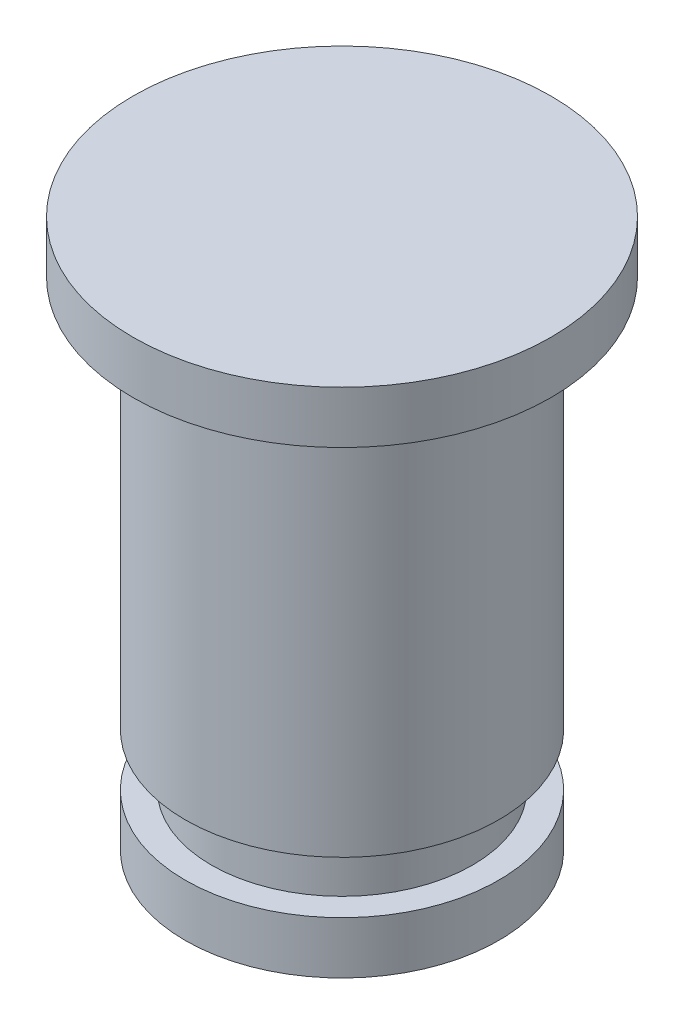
ISO-10303-21;
HEADER;
FILE_DESCRIPTION(('STEP AP214'),'2;1');
FILE_NAME('part.step','',(''),(''),'','','');
FILE_SCHEMA(('AUTOMOTIVE_DESIGN { 1 0 10303 214 1 1 1 1 }'));
ENDSEC;
DATA;
#1=APPLICATION_CONTEXT('core data for automotive mechanical design processes');
#2=APPLICATION_PROTOCOL_DEFINITION('international standard','automotive_design',2000,#1);
#3=PRODUCT_CONTEXT('',#1,'mechanical');
#4=PRODUCT('Part','Part','',(#3));
#5=PRODUCT_RELATED_PRODUCT_CATEGORY('part','',(#4));
#6=PRODUCT_DEFINITION_FORMATION('','',#4);
#7=PRODUCT_DEFINITION_CONTEXT('part definition',#1,'design');
#8=PRODUCT_DEFINITION('design','',#6,#7);
#9=PRODUCT_DEFINITION_SHAPE('','',#8);
#10=(LENGTH_UNIT() NAMED_UNIT(*) SI_UNIT(.MILLI.,.METRE.));
#11=(NAMED_UNIT(*) PLANE_ANGLE_UNIT() SI_UNIT($,.RADIAN.));
#12=(NAMED_UNIT(*) SI_UNIT($,.STERADIAN.) SOLID_ANGLE_UNIT());
#13=UNCERTAINTY_MEASURE_WITH_UNIT(LENGTH_MEASURE(1.E-05),#10,'distance_accuracy_value','');
#14=(GEOMETRIC_REPRESENTATION_CONTEXT(3) GLOBAL_UNCERTAINTY_ASSIGNED_CONTEXT((#13)) GLOBAL_UNIT_ASSIGNED_CONTEXT((#10,
#11,#12)) REPRESENTATION_CONTEXT('',''));
#15=CARTESIAN_POINT('',(0.,0.,0.));
#16=DIRECTION('',(0.,0.,1.));
#17=DIRECTION('',(1.,0.,0.));
#18=AXIS2_PLACEMENT_3D('',#15,#16,#17);
#19=CARTESIAN_POINT('',(1.5,0.,0.));
#20=DIRECTION('',(0.,-1.,0.));
#21=DIRECTION('',(0.,0.,-1.));
#22=AXIS2_PLACEMENT_3D('',#19,#20,#21);
#23=PLANE('',#22);
#24=CARTESIAN_POINT('',(0.,0.,0.));
#25=DIRECTION('',(0.,-1.,0.));
#26=DIRECTION('',(0.,0.,-1.));
#27=AXIS2_PLACEMENT_3D('',#24,#25,#26);
#28=CIRCLE('',#27,3.);
#29=CARTESIAN_POINT('',(0.,0.,-3.));
#30=VERTEX_POINT('',#29);
#31=EDGE_CURVE('E17',#30,#30,#28,.F.);
#32=ORIENTED_EDGE('',*,*,#31,.F.);
#33=EDGE_LOOP('',(#32));
#34=FACE_BOUND('',#33,.T.);
#35=ADVANCED_FACE('F13',(#34),#23,.T.);
#36=CARTESIAN_POINT('',(0.,0.5,0.));
#37=DIRECTION('',(0.,-1.,0.));
#38=DIRECTION('',(0.,0.,-1.));
#39=AXIS2_PLACEMENT_3D('',#36,#37,#38);
#40=CYLINDRICAL_SURFACE('',#39,3.);
#41=CARTESIAN_POINT('',(0.,1.,0.));
#42=DIRECTION('',(0.,-1.,0.));
#43=DIRECTION('',(0.,0.,-1.));
#44=AXIS2_PLACEMENT_3D('',#41,#42,#43);
#45=CIRCLE('',#44,3.);
#46=CARTESIAN_POINT('',(0.,1.,-3.));
#47=VERTEX_POINT('',#46);
#48=EDGE_CURVE('E39',#47,#47,#45,.F.);
#49=ORIENTED_EDGE('',*,*,#48,.F.);
#50=EDGE_LOOP('',(#49));
#51=FACE_BOUND('',#50,.T.);
#52=ORIENTED_EDGE('',*,*,#31,.T.);
#53=EDGE_LOOP('',(#52));
#54=FACE_BOUND('',#53,.T.);
#55=ADVANCED_FACE('F46',(#51,#54),#40,.T.);
#56=CARTESIAN_POINT('',(2.75,1.,0.));
#57=DIRECTION('',(0.,1.,0.));
#58=DIRECTION('',(0.,0.,1.));
#59=AXIS2_PLACEMENT_3D('',#56,#57,#58);
#60=PLANE('',#59);
#61=CARTESIAN_POINT('',(0.,1.,0.));
#62=DIRECTION('',(0.,-1.,0.));
#63=DIRECTION('',(0.,0.,-1.));
#64=AXIS2_PLACEMENT_3D('',#61,#62,#63);
#65=CIRCLE('',#64,2.5);
#66=CARTESIAN_POINT('',(0.,1.,-2.5));
#67=VERTEX_POINT('',#66);
#68=EDGE_CURVE('E37',#67,#67,#65,.F.);
#69=ORIENTED_EDGE('',*,*,#68,.F.);
#70=EDGE_LOOP('',(#69));
#71=FACE_BOUND('',#70,.T.);
#72=ORIENTED_EDGE('',*,*,#48,.T.);
#73=EDGE_LOOP('',(#72));
#74=FACE_BOUND('',#73,.T.);
#75=ADVANCED_FACE('F54',(#71,#74),#60,.T.);
#76=CARTESIAN_POINT('',(2.,10.5,0.));
#77=DIRECTION('',(0.,1.,0.));
#78=DIRECTION('',(0.,0.,1.));
#79=AXIS2_PLACEMENT_3D('',#76,#77,#78);
#80=PLANE('',#79);
#81=CARTESIAN_POINT('',(0.,10.5,0.));
#82=DIRECTION('',(0.,-1.,0.));
#83=DIRECTION('',(0.,0.,-1.));
#84=AXIS2_PLACEMENT_3D('',#81,#82,#83);
#85=CIRCLE('',#84,4.);
#86=CARTESIAN_POINT('',(0.,10.5,-4.));
#87=VERTEX_POINT('',#86);
#88=EDGE_CURVE('E34',#87,#87,#85,.T.);
#89=ORIENTED_EDGE('',*,*,#88,.F.);
#90=EDGE_LOOP('',(#89));
#91=FACE_BOUND('',#90,.T.);
#92=ADVANCED_FACE('F80',(#91),#80,.T.);
#93=CARTESIAN_POINT('',(0.,1.5,0.));
#94=DIRECTION('',(0.,-1.,0.));
#95=DIRECTION('',(0.,0.,-1.));
#96=AXIS2_PLACEMENT_3D('',#93,#94,#95);
#97=CYLINDRICAL_SURFACE('',#96,2.5);
#98=CARTESIAN_POINT('',(0.,2.,0.));
#99=DIRECTION('',(0.,-1.,0.));
#100=DIRECTION('',(0.,0.,-1.));
#101=AXIS2_PLACEMENT_3D('',#98,#99,#100);
#102=CIRCLE('',#101,2.5);
#103=CARTESIAN_POINT('',(0.,2.,-2.5));
#104=VERTEX_POINT('',#103);
#105=EDGE_CURVE('E31',#104,#104,#102,.F.);
#106=ORIENTED_EDGE('',*,*,#105,.F.);
#107=EDGE_LOOP('',(#106));
#108=FACE_BOUND('',#107,.T.);
#109=ORIENTED_EDGE('',*,*,#68,.T.);
#110=EDGE_LOOP('',(#109));
#111=FACE_BOUND('',#110,.T.);
#112=ADVANCED_FACE('F74',(#108,#111),#97,.T.);
#113=CARTESIAN_POINT('',(0.,10.,0.));
#114=DIRECTION('',(0.,-1.,0.));
#115=DIRECTION('',(0.,0.,-1.));
#116=AXIS2_PLACEMENT_3D('',#113,#114,#115);
#117=CYLINDRICAL_SURFACE('',#116,4.);
#118=ORIENTED_EDGE('',*,*,#88,.T.);
#119=EDGE_LOOP('',(#118));
#120=FACE_BOUND('',#119,.T.);
#121=CARTESIAN_POINT('',(0.,9.5,0.));
#122=DIRECTION('',(0.,-1.,0.));
#123=DIRECTION('',(0.,0.,-1.));
#124=AXIS2_PLACEMENT_3D('',#121,#122,#123);
#125=CIRCLE('',#124,4.);
#126=CARTESIAN_POINT('',(0.,9.5,-4.));
#127=VERTEX_POINT('',#126);
#128=EDGE_CURVE('E26',#127,#127,#125,.T.);
#129=ORIENTED_EDGE('',*,*,#128,.F.);
#130=EDGE_LOOP('',(#129));
#131=FACE_BOUND('',#130,.T.);
#132=ADVANCED_FACE('F68',(#120,#131),#117,.T.);
#133=CARTESIAN_POINT('',(2.75,2.,0.));
#134=DIRECTION('',(0.,-1.,0.));
#135=DIRECTION('',(0.,0.,-1.));
#136=AXIS2_PLACEMENT_3D('',#133,#134,#135);
#137=PLANE('',#136);
#138=ORIENTED_EDGE('',*,*,#105,.T.);
#139=EDGE_LOOP('',(#138));
#140=FACE_BOUND('',#139,.T.);
#141=CARTESIAN_POINT('',(0.,2.,0.));
#142=DIRECTION('',(0.,-1.,0.));
#143=DIRECTION('',(0.,0.,-1.));
#144=AXIS2_PLACEMENT_3D('',#141,#142,#143);
#145=CIRCLE('',#144,3.);
#146=CARTESIAN_POINT('',(0.,2.,-3.));
#147=VERTEX_POINT('',#146);
#148=EDGE_CURVE('E21',#147,#147,#145,.F.);
#149=ORIENTED_EDGE('',*,*,#148,.F.);
#150=EDGE_LOOP('',(#149));
#151=FACE_BOUND('',#150,.T.);
#152=ADVANCED_FACE('F62',(#140,#151),#137,.T.);
#153=CARTESIAN_POINT('',(3.5,9.5,0.));
#154=DIRECTION('',(0.,-1.,0.));
#155=DIRECTION('',(0.,0.,-1.));
#156=AXIS2_PLACEMENT_3D('',#153,#154,#155);
#157=PLANE('',#156);
#158=CARTESIAN_POINT('',(0.,9.5,0.));
#159=DIRECTION('',(0.,-1.,0.));
#160=DIRECTION('',(0.,0.,-1.));
#161=AXIS2_PLACEMENT_3D('',#158,#159,#160);
#162=CIRCLE('',#161,3.);
#163=CARTESIAN_POINT('',(0.,9.5,-3.));
#164=VERTEX_POINT('',#163);
#165=EDGE_CURVE('E9',#164,#164,#162,.T.);
#166=ORIENTED_EDGE('',*,*,#165,.F.);
#167=EDGE_LOOP('',(#166));
#168=FACE_BOUND('',#167,.T.);
#169=ORIENTED_EDGE('',*,*,#128,.T.);
#170=EDGE_LOOP('',(#169));
#171=FACE_BOUND('',#170,.T.);
#172=ADVANCED_FACE('F58',(#168,#171),#157,.T.);
#173=CARTESIAN_POINT('',(0.,5.75,0.));
#174=DIRECTION('',(0.,-1.,0.));
#175=DIRECTION('',(0.,0.,-1.));
#176=AXIS2_PLACEMENT_3D('',#173,#174,#175);
#177=CYLINDRICAL_SURFACE('',#176,3.);
#178=ORIENTED_EDGE('',*,*,#165,.T.);
#179=EDGE_LOOP('',(#178));
#180=FACE_BOUND('',#179,.T.);
#181=ORIENTED_EDGE('',*,*,#148,.T.);
#182=EDGE_LOOP('',(#181));
#183=FACE_BOUND('',#182,.T.);
#184=ADVANCED_FACE('F15',(#180,#183),#177,.T.);
#185=CLOSED_SHELL('',(#35,#55,#75,#92,#112,#132,#152,#172,#184));
#186=MANIFOLD_SOLID_BREP('B1',#185);
#187=ADVANCED_BREP_SHAPE_REPRESENTATION('',(#18,#186),#14);
#188=SHAPE_DEFINITION_REPRESENTATION(#9,#187);
ENDSEC;
END-ISO-10303-21;
